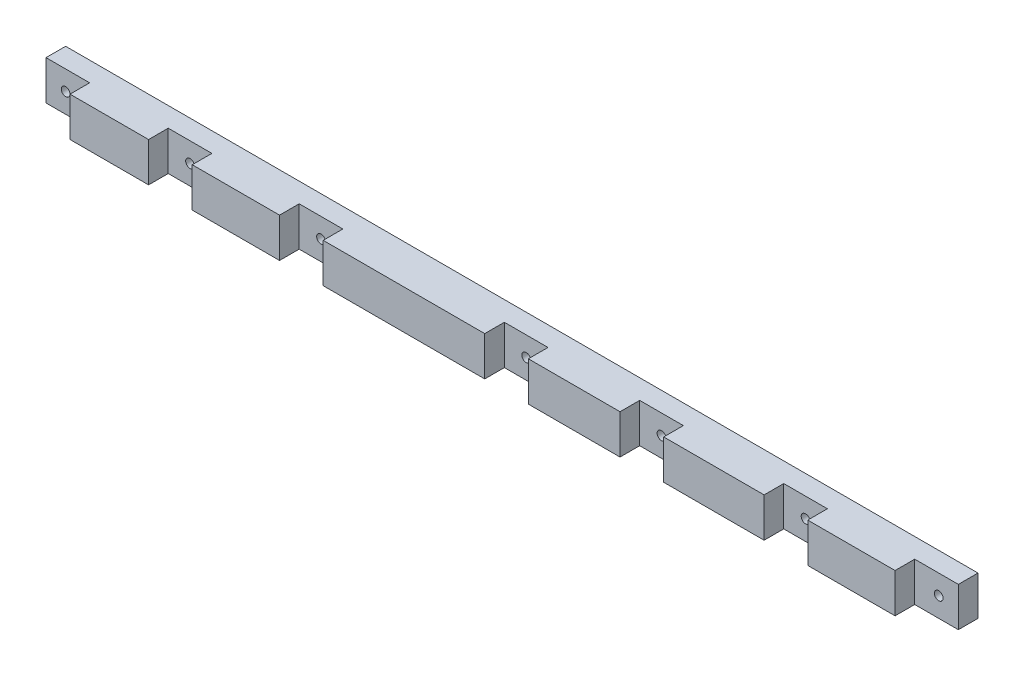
from build123d import *

# Parameters (mm, degrees)
ESQUISSE1_W              = 209
ESQUISSE1_H              = 9
EXTRUSION1_DEPTH         = 9
ESQUISSE2_W              = 10
ESQUISSE2_H              = 9
ENL_V_MAT_EXTRU_1_DEPTH  = 4.5
ESQUISSE4_R              = 1
ENL_V_MAT_EXTRU_2_DEPTH  = 4.5
ESQUISSE5_W              = 10
ESQUISSE5_H              = 9
ENL_V_MAT_EXTRU_3_DEPTH  = 4.5
ESQUISSE6_W              = 10
ESQUISSE6_H              = 9
ENL_V_MAT_EXTRU_4_DEPTH  = 4.5
ESQUISSE7_W              = 10
ESQUISSE7_H              = 9
ENL_V_MAT_EXTRU_5_DEPTH  = 4.5
ESQUISSE8_W              = 10
ESQUISSE8_H              = 9
ENL_V_MAT_EXTRU_6_DEPTH  = 4.5
ESQUISSE9_W              = 10
ESQUISSE9_H              = 9
ENL_V_MAT_EXTRU_7_DEPTH  = 4.5
ESQUISSE10_W             = 10
ESQUISSE10_H             = 9
ENL_V_MAT_EXTRU_8_DEPTH  = 4.5
ESQUISSE11_R             = 1
ENL_V_MAT_EXTRU_9_DEPTH  = 4.5
ESQUISSE12_R             = 1
ENL_V_MAT_EXTRU_10_DEPTH = 4.5
ESQUISSE13_R             = 1
ENL_V_MAT_EXTRU_11_DEPTH = 4.5
ESQUISSE14_R             = 1
ENL_V_MAT_EXTRU_12_DEPTH = 4.5
ESQUISSE15_R             = 1
ENL_V_MAT_EXTRU_13_DEPTH = 4.5
ESQUISSE16_R             = 1
ENL_V_MAT_EXTRU_14_DEPTH = 4.5


with BuildPart() as part:
    # Esquisse1 → Extrusion1 (new body)
    with BuildSketch(Plane.XY):
        with Locations((104.5, 4.5)):
            Rectangle(ESQUISSE1_W, ESQUISSE1_H)
    extrude(amount=EXTRUSION1_DEPTH)

    # Esquisse2 → Enl_v. mat.-Extru.1 (cut)
    with BuildSketch(Plane.XY.offset(9)):
        with Locations((204, 4.5)):
            Rectangle(ESQUISSE2_W, ESQUISSE2_H)
    extrude(amount=-ENL_V_MAT_EXTRU_1_DEPTH, mode=Mode.SUBTRACT)

    # Esquisse4 → Enl_v. mat.-Extru.2 (cut)
    with BuildSketch(Plane.XY.offset(4.5)):
        with Locations((204.5, 4.5)):
            Circle(ESQUISSE4_R)
    extrude(amount=-ENL_V_MAT_EXTRU_2_DEPTH, mode=Mode.SUBTRACT)

    # Esquisse5 → Enl_v. mat.-Extru.3 (cut)
    with BuildSketch(Plane.XY.offset(9)):
        with Locations((5, 4.5)):
            Rectangle(ESQUISSE5_W, ESQUISSE5_H)
    extrude(amount=-ENL_V_MAT_EXTRU_3_DEPTH, mode=Mode.SUBTRACT)

    # Esquisse6 → Enl_v. mat.-Extru.4 (cut)
    with BuildSketch(Plane.XY.offset(9)):
        with Locations((33, 4.5)):
            Rectangle(ESQUISSE6_W, ESQUISSE6_H)
    extrude(amount=-ENL_V_MAT_EXTRU_4_DEPTH, mode=Mode.SUBTRACT)

    # Esquisse7 → Enl_v. mat.-Extru.5 (cut)
    with BuildSketch(Plane.XY.offset(9)):
        with Locations((63, 4.5)):
            Rectangle(ESQUISSE7_W, ESQUISSE7_H)
    extrude(amount=-ENL_V_MAT_EXTRU_5_DEPTH, mode=Mode.SUBTRACT)

    # Esquisse8 → Enl_v. mat.-Extru.6 (cut)
    with BuildSketch(Plane.XY.offset(9)):
        with Locations((110, 4.5)):
            Rectangle(ESQUISSE8_W, ESQUISSE8_H)
    extrude(amount=-ENL_V_MAT_EXTRU_6_DEPTH, mode=Mode.SUBTRACT)

    # Esquisse9 → Enl_v. mat.-Extru.7 (cut)
    with BuildSketch(Plane.XY.offset(9)):
        with Locations((141, 4.5)):
            Rectangle(ESQUISSE9_W, ESQUISSE9_H)
    extrude(amount=-ENL_V_MAT_EXTRU_7_DEPTH, mode=Mode.SUBTRACT)

    # Esquisse10 → Enl_v. mat.-Extru.8 (cut)
    with BuildSketch(Plane.XY.offset(9)):
        with Locations((174, 4.5)):
            Rectangle(ESQUISSE10_W, ESQUISSE10_H)
    extrude(amount=-ENL_V_MAT_EXTRU_8_DEPTH, mode=Mode.SUBTRACT)

    # Esquisse11 → Enl_v. mat.-Extru.9 (cut)
    with BuildSketch(Plane.XY.offset(4.5)):
        with Locations((4.5, 4.5)):
            Circle(ESQUISSE11_R)
    extrude(amount=-ENL_V_MAT_EXTRU_9_DEPTH, mode=Mode.SUBTRACT)

    # Esquisse12 → Enl_v. mat.-Extru.10 (cut)
    with BuildSketch(Plane.XY.offset(4.5)):
        with Locations((33, 4.5)):
            Circle(ESQUISSE12_R)
    extrude(amount=-ENL_V_MAT_EXTRU_10_DEPTH, mode=Mode.SUBTRACT)

    # Esquisse13 → Enl_v. mat.-Extru.11 (cut)
    with BuildSketch(Plane.XY.offset(4.5)):
        with Locations((63, 4.5)):
            Circle(ESQUISSE13_R)
    extrude(amount=-ENL_V_MAT_EXTRU_11_DEPTH, mode=Mode.SUBTRACT)

    # Esquisse14 → Enl_v. mat.-Extru.12 (cut)
    with BuildSketch(Plane.XY.offset(4.5)):
        with Locations((110, 4.5)):
            Circle(ESQUISSE14_R)
    extrude(amount=-ENL_V_MAT_EXTRU_12_DEPTH, mode=Mode.SUBTRACT)

    # Esquisse15 → Enl_v. mat.-Extru.13 (cut)
    with BuildSketch(Plane.XY.offset(4.5)):
        with Locations((141, 4.5)):
            Circle(ESQUISSE15_R)
    extrude(amount=-ENL_V_MAT_EXTRU_13_DEPTH, mode=Mode.SUBTRACT)

    # Esquisse16 → Enl_v. mat.-Extru.14 (cut)
    with BuildSketch(Plane.XY.offset(4.5)):
        with Locations((174, 4.5)):
            Circle(ESQUISSE16_R)
    extrude(amount=-ENL_V_MAT_EXTRU_14_DEPTH, mode=Mode.SUBTRACT)


solid = part.part
